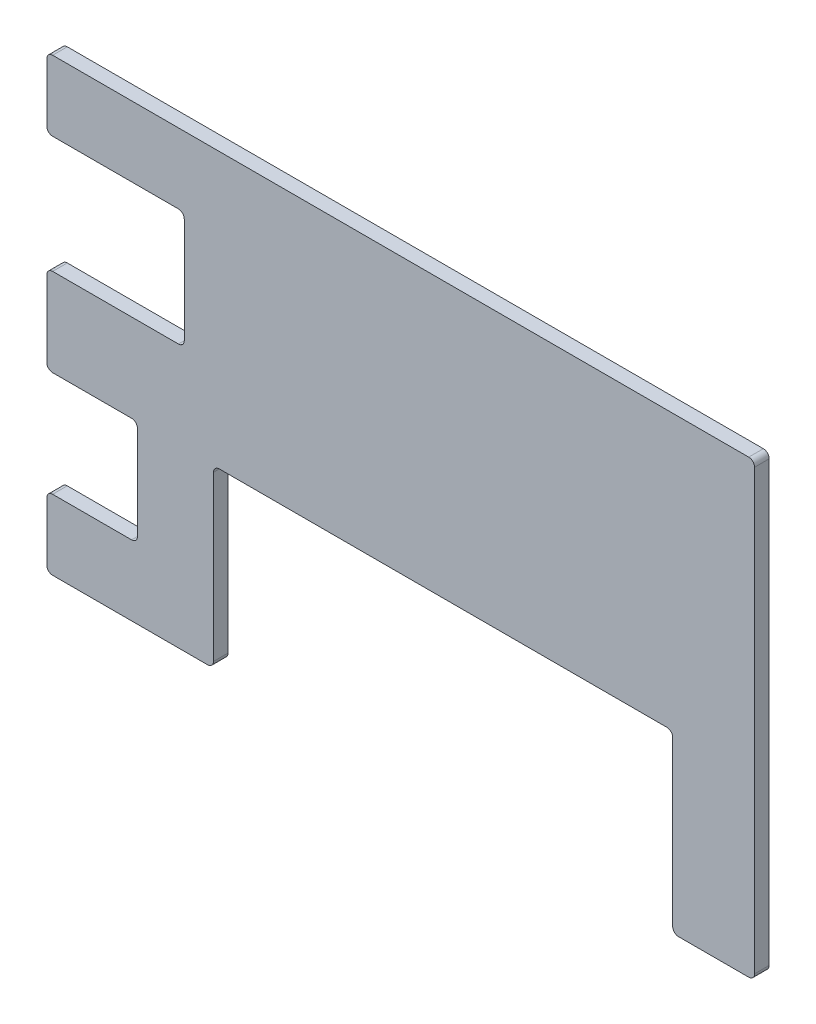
from build123d import *

# Parameters (mm, degrees)
BOSS_EXTRUDE1_DEPTH = 2.5


with BuildPart() as part:
    # Sketch2 → Boss-Extrude1 (new body)
    with BuildSketch(Plane.XY):
        with BuildLine():
            Line((-60.5, 37), (-60.5, 27))
            ThreePointArc((-60.5, 27), (-60.207107, 26.292893), (-59.5, 26))
            Line((-59.5, 26), (-38, 26))
            ThreePointArc((-38, 26), (-37.292893, 25.707107), (-37, 25))
            Line((-37, 25), (-37, 7))
            ThreePointArc((-37, 7), (-37.292893, 6.292893), (-38, 6))
            Line((-38, 6), (-59.5, 6))
            ThreePointArc((-59.5, 6), (-60.207107, 5.707107), (-60.5, 5))
            Line((-60.5, 5), (-60.5, -8))
            ThreePointArc((-60.5, -8), (-60.207107, -8.707107), (-59.5, -9))
            Line((-59.5, -9), (-46, -9))
            ThreePointArc((-46, -9), (-45.292893, -9.292893), (-45, -10))
            Line((-45, -10), (-45, -26))
            ThreePointArc((-45, -26), (-45.292893, -26.707107), (-46, -27))
            Line((-46, -27), (-59.5, -27))
            ThreePointArc((-59.5, -27), (-60.207107, -27.292893), (-60.5, -28))
            Line((-60.5, -28), (-60.5, -38))
            ThreePointArc((-60.5, -38), (-60.207107, -38.707107), (-59.5, -39))
            Line((-59.5, -39), (-33, -39))
            ThreePointArc((-33, -39), (-32.292893, -38.707107), (-32, -38))
            Line((-32, -38), (-32, -10))
            ThreePointArc((-32, -10), (-31.707107, -9.292893), (-31, -9))
            Line((-31, -9), (45.5, -9))
            ThreePointArc((45.5, -9), (46.207107, -9.292893), (46.5, -10))
            Line((46.5, -10), (46.5, -38))
            ThreePointArc((46.5, -38), (46.792893, -38.707107), (47.5, -39))
            Line((47.5, -39), (59.5, -39))
            ThreePointArc((59.5, -39), (60.207107, -38.707107), (60.5, -38))
            Line((60.5, -38), (60.5, 37))
            ThreePointArc((60.5, 37), (60.207107, 37.707107), (59.5, 38))
            Line((59.5, 38), (-59.5, 38))
            ThreePointArc((-59.5, 38), (-60.207107, 37.707107), (-60.5, 37))
        make_face()
    extrude(amount=BOSS_EXTRUDE1_DEPTH)


solid = part.part
